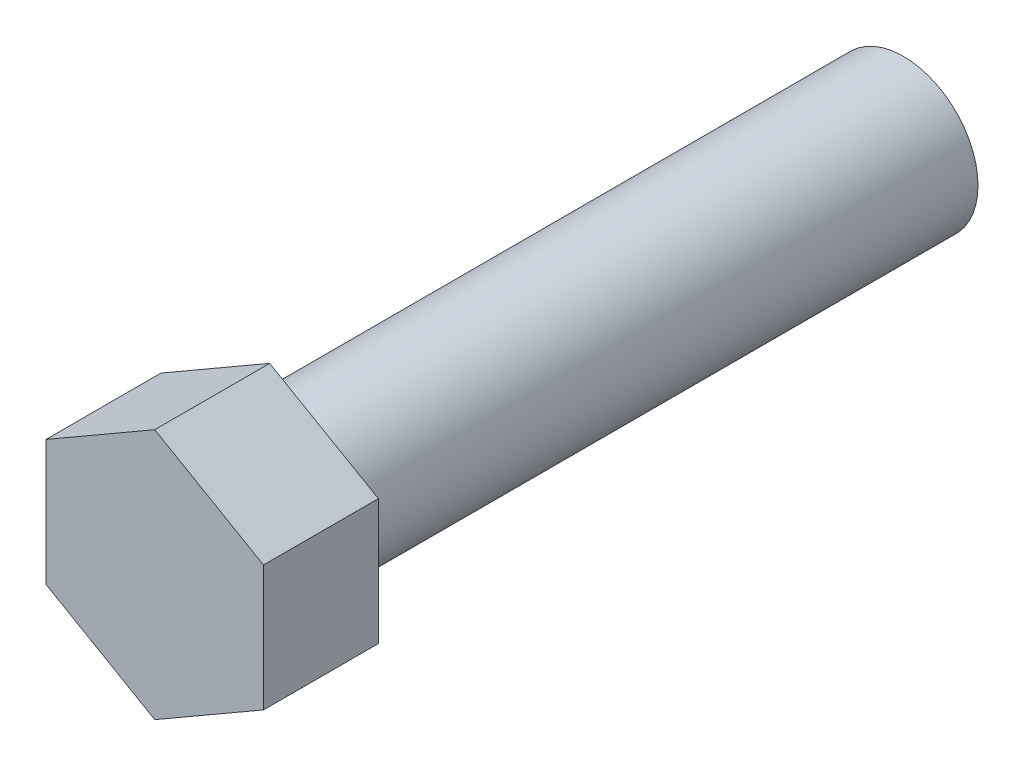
from build123d import *

# Parameters (mm, degrees)
BOLT_HEAD_DEPTH = 58.7375
SK_BODY_R       = 38.1
BOLT_BODY_DEPTH = 323.85


with BuildPart() as part:
    # Sketch3 → bolt Head (new body)
    with BuildSketch(Plane(origin=(0, 0, 0), x_dir=(0, 1, 0), z_dir=(0, 0, 1))):
        Polygon((64.158048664, 0), (32.079024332, 55.5625), (-32.079024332, 55.5625), (-64.158048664, 0), (-32.079024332, -55.5625), (32.079024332, -55.5625), align=None)
    extrude(amount=BOLT_HEAD_DEPTH)

    # sk body → bolt Body (add)
    with BuildSketch(Plane(origin=(0, 0, 0), x_dir=(0, 1, 0), z_dir=(0, 0, 1))):
        with Locations(Location((0, 0, 0), (0, 0, 270))):
            Circle(SK_BODY_R)
    extrude(amount=-BOLT_BODY_DEPTH)


solid = part.part
